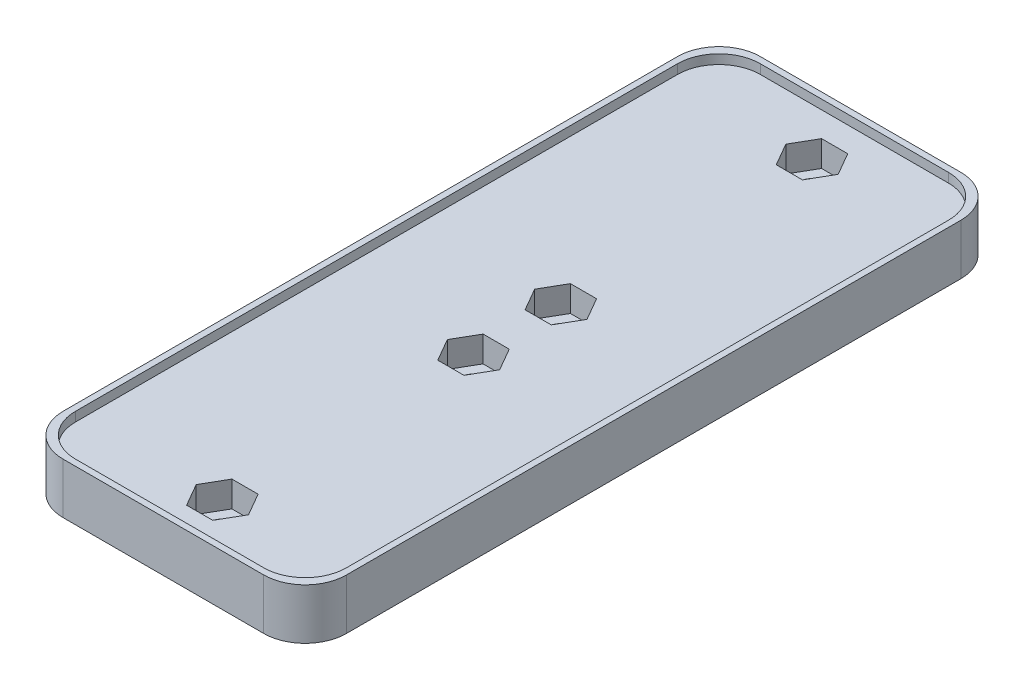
from build123d import *

# Parameters (mm, degrees)
SKETCH1_W           = 33.02
SKETCH1_H           = 83.82
BOSS_EXTRUDE1_DEPTH = 5.08
CUT_EXTRUDE1_DEPTH  = 3.175
SKETCH4_R           = 1.5875
CUT_EXTRUDE2_DEPTH  = 7.62
SKETCH6_W           = 33.274
SKETCH6_H           = 84.074
SKETCH6_W_2         = 33.02
SKETCH6_H_2         = 83.82
BOSS_EXTRUDE2_DEPTH = 5.08
SKETCH7_W           = 34.798
SKETCH7_H           = 85.598
SKETCH7_W_2         = 33.274
SKETCH7_H_2         = 84.074
BOSS_EXTRUDE3_DEPTH = 6.223
FILLET3_R           = 5.08
FILLET4_R           = 5.08
FILLET5_R           = 5.08
FILLET6_R           = 5.08
FILLET7_R           = 5.08
FILLET8_R           = 5.08
FILLET9_R           = 5.08
FILLET10_R          = 5.08


with BuildPart() as part:
    # Sketch1 → Boss-Extrude1 (new body)
    with BuildSketch(Plane(origin=(0, 0, 0), x_dir=(1, 0, 0), z_dir=(0, 1, 0))):
        with Locations((16.51, 41.91)):
            Rectangle(SKETCH1_W, SKETCH1_H)
    extrude(amount=BOSS_EXTRUDE1_DEPTH)

    # Sketch2 → Cut-Extrude1 (cut)
    with BuildSketch(Plane(origin=(0, 5.08, 0), x_dir=(1, 0, 0), z_dir=(0, 1, 0))):
        Polygon((20.356568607, 5.715), (18.750784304, 8.4963), (15.539215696, 8.4963), (13.933431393, 5.715), (15.539215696, 2.9337), (18.750784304, 2.9337), align=None)
        Polygon((20.356568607, 78.105), (18.750784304, 80.8863), (15.539215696, 80.8863), (13.933431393, 78.105), (15.539215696, 75.3237), (18.750784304, 75.3237), align=None)
        Polygon((20.356568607, 36.5506), (18.750784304, 39.3319), (15.539215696, 39.3319), (13.933431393, 36.5506), (15.539215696, 33.7693), (18.750784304, 33.7693), align=None)
        Polygon((20.356568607, 47.2694), (18.750784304, 50.0507), (15.539215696, 50.0507), (13.933431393, 47.2694), (15.539215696, 44.4881), (18.750784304, 44.4881), align=None)
    extrude(amount=-CUT_EXTRUDE1_DEPTH, mode=Mode.SUBTRACT)

    # Sketch4 → Cut-Extrude2 (cut)
    with BuildSketch(Plane(origin=(0, 5.08, 0), x_dir=(1, 0, 0), z_dir=(0, 1, 0))):
        with Locations(Location((17.145, 5.715, 0), (0, 0, 270))):
            Circle(SKETCH4_R)
        with Locations(Location((17.145, 36.5506, 0), (0, 0, 270))):
            Circle(SKETCH4_R)
        with Locations(Location((17.145, 47.2694, 0), (0, 0, 270))):
            Circle(SKETCH4_R)
        with Locations(Location((17.145, 78.105, 0), (0, 0, 270))):
            Circle(SKETCH4_R)
    extrude(amount=-CUT_EXTRUDE2_DEPTH, mode=Mode.SUBTRACT)

    # Sketch6 → Boss-Extrude2 (add)
    with BuildSketch(Plane.XZ):
        with Locations((16.51, -41.91)):
            Rectangle(SKETCH6_W, SKETCH6_H)
        with Locations((16.51, -41.91)):
            Rectangle(SKETCH6_W_2, SKETCH6_H_2, mode=Mode.SUBTRACT)
    extrude(amount=-BOSS_EXTRUDE2_DEPTH)

    # Sketch7 → Boss-Extrude3 (add)
    with BuildSketch(Plane.XZ):
        with Locations((16.51, -41.91)):
            Rectangle(SKETCH7_W, SKETCH7_H)
        with Locations((16.51, -41.91)):
            Rectangle(SKETCH7_W_2, SKETCH7_H_2, mode=Mode.SUBTRACT)
    extrude(amount=-BOSS_EXTRUDE3_DEPTH)

    # Fillet3
    fillet3_edges = [part.edges().sort_by_distance(p)[0] for p in [
        (-0.127, 5.6515, -83.947),
    ]]
    fillet(fillet3_edges, radius=FILLET3_R)

    # Fillet4
    fillet4_edges = [part.edges().sort_by_distance(p)[0] for p in [
        (-0.889, 3.1115, -84.709),
    ]]
    fillet(fillet4_edges, radius=FILLET4_R)

    # Fillet5
    fillet5_edges = [part.edges().sort_by_distance(p)[0] for p in [
        (33.147, 5.6515, -83.947),
    ]]
    fillet(fillet5_edges, radius=FILLET5_R)

    # Fillet6
    fillet6_edges = [part.edges().sort_by_distance(p)[0] for p in [
        (33.147, 5.6515, 0.127),
    ]]
    fillet(fillet6_edges, radius=FILLET6_R)

    # Fillet7
    fillet7_edges = [part.edges().sort_by_distance(p)[0] for p in [
        (-0.127, 5.6515, 0.127),
    ]]
    fillet(fillet7_edges, radius=FILLET7_R)

    # Fillet8
    fillet8_edges = [part.edges().sort_by_distance(p)[0] for p in [
        (33.909, 3.1115, 0.889),
    ]]
    fillet(fillet8_edges, radius=FILLET8_R)

    # Fillet9
    fillet9_edges = [part.edges().sort_by_distance(p)[0] for p in [
        (-0.889, 3.1115, 0.889),
    ]]
    fillet(fillet9_edges, radius=FILLET9_R)

    # Fillet10
    fillet10_edges = [part.edges().sort_by_distance(p)[0] for p in [
        (33.909, 3.1115, -84.709),
    ]]
    fillet(fillet10_edges, radius=FILLET10_R)


solid = part.part
